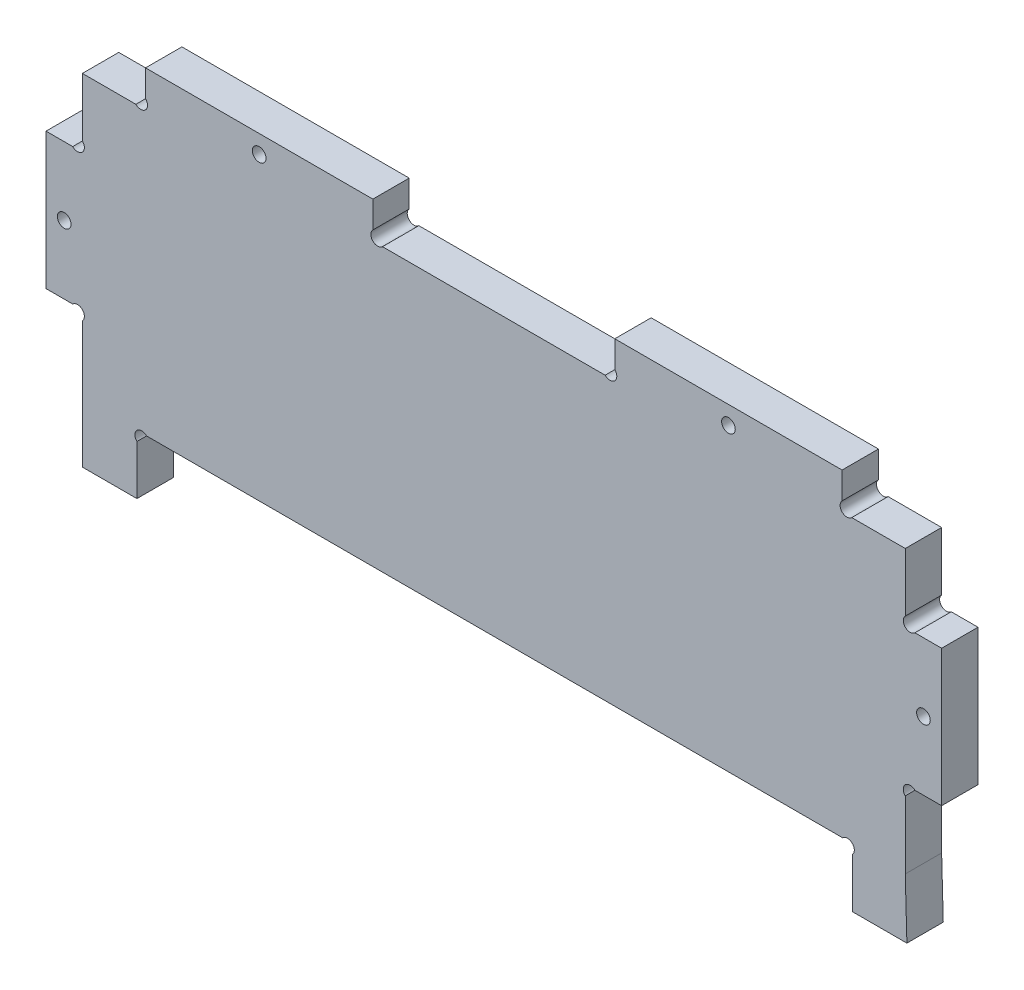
from build123d import *

# Parameters (mm, degrees)
ESQUISSE1_R        = 1.5
ESQUISSE1_R_2      = 1.499999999
BOSS_EXTRU_1_DEPTH = 8


with BuildPart() as part:
    # Esquisse1 → Boss.-Extru.1 (new body)
    with BuildSketch(Plane.XY):
        with BuildLine():
            Line((-17.936180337, -36.536710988), (135.179966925, -36.536710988))
            ThreePointArc((135.179966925, -36.536710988), (137.30128727, -36.536710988), (137.301287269, -38.658031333))
            Line((137.301287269, -38.658031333), (137.301287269, -49.53671103))
            Line((137.301287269, -49.53671103), (149.301287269, -49.53671103))
            Line((149.301287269, -49.53671103), (148.94249932, -36.536710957))
            Line((148.94249932, -36.536710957), (148.94249932, -21.658031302))
            ThreePointArc((148.94249932, -21.658031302), (148.94249932, -19.536710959), (151.063819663, -19.536710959))
            Line((151.063819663, -19.536710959), (156.94249932, -19.536710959))
            Line((156.94249932, -19.536710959), (156.94249932, 10.463289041))
            Line((156.94249932, 10.463289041), (151.063819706, 10.463289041))
            ThreePointArc((151.063819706, 10.463289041), (148.942499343, 10.463289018), (148.94249932, 12.584609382))
            Line((148.94249932, 12.584609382), (148.94249932, 25.463289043))
            Line((148.94249932, 25.463289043), (137.170721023, 25.463289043))
            ThreePointArc((137.170721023, 25.463289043), (135.049400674, 25.463289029), (135.04940067, 27.584609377))
            Line((135.04940067, 27.584609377), (135.04940067, 33.463289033))
            Line((135.04940067, 33.463289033), (85.049316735, 33.463289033))
            Line((85.049316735, 33.463289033), (85.049316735, 27.584609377))
            ThreePointArc((85.049316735, 27.584609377), (85.049316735, 25.463289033), (82.927996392, 25.463289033))
            Line((82.927996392, 25.463289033), (33.957003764, 25.463289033))
            ThreePointArc((33.957003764, 25.463289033), (31.83568342, 25.463289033), (31.83568342, 27.584609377))
            Line((31.83568342, 27.584609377), (31.83568342, 33.463289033))
            Line((31.83568342, 33.463289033), (-18.164400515, 33.463289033))
            Line((-18.164400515, 33.463289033), (-18.164400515, 27.584609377))
            ThreePointArc((-18.164400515, 27.584609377), (-18.164400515, 25.463289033), (-20.285720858, 25.463289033))
            Line((-20.285720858, 25.463289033), (-32.05750068, 25.463289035))
            Line((-32.05750068, 25.463289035), (-32.05750068, 12.584609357))
            ThreePointArc((-32.05750068, 12.584609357), (-32.057500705, 10.463289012), (-34.17882105, 10.463289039))
            Line((-34.17882105, 10.463289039), (-40.05750068, 10.463289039))
            Line((-40.05750068, 10.463289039), (-40.05750068, -19.536710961))
            Line((-40.05750068, -19.536710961), (-34.178821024, -19.536710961))
            ThreePointArc((-34.178821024, -19.536710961), (-32.05750068, -19.536710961), (-32.05750068, -21.658031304))
            Line((-32.05750068, -21.658031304), (-32.05750068, -36.536710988))
            Line((-32.05750068, -36.536710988), (-32.05750068, -49.53671099))
            Line((-32.05750068, -49.53671099), (-20.05750068, -49.53671099))
            Line((-20.05750068, -49.53671099), (-20.05750068, -38.658031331))
            ThreePointArc((-20.05750068, -38.658031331), (-20.05750068, -36.536710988), (-17.936180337, -36.536710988))
        make_face()
        with Locations((6.835641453, 29.463289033)):
            Circle(ESQUISSE1_R, mode=Mode.SUBTRACT)
        with Locations((110.049358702, 29.463289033)):
            Circle(ESQUISSE1_R, mode=Mode.SUBTRACT)
        with Locations((152.94249932, -4.536710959)):
            Circle(ESQUISSE1_R_2, mode=Mode.SUBTRACT)
        with Locations((-36.05750068, -4.536710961)):
            Circle(ESQUISSE1_R_2, mode=Mode.SUBTRACT)
    extrude(amount=BOSS_EXTRU_1_DEPTH)


solid = part.part
